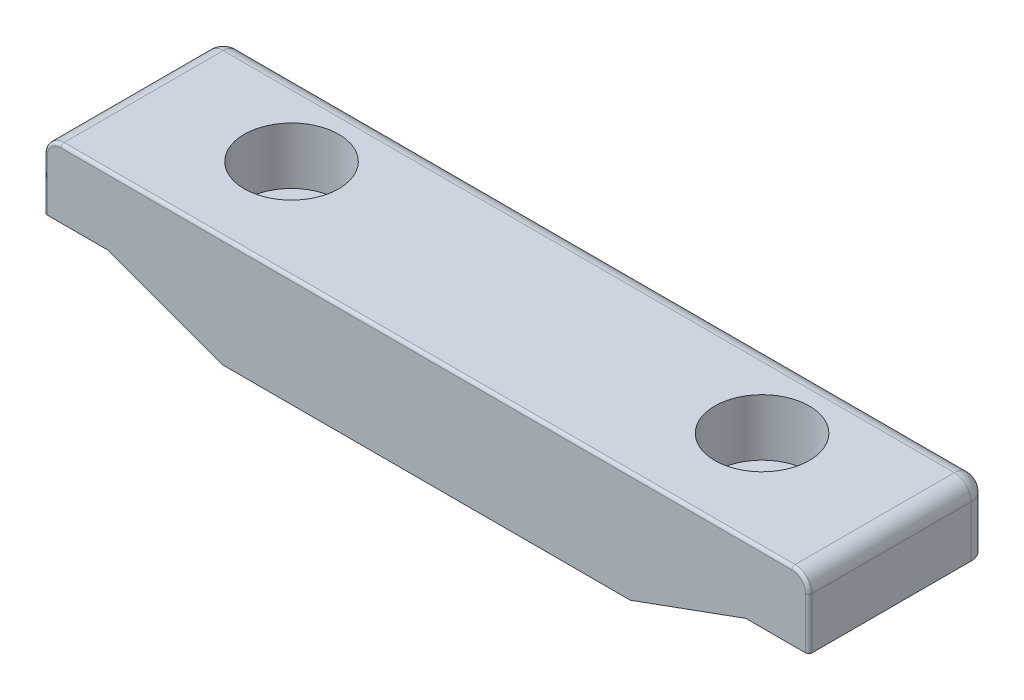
ISO-10303-21;
HEADER;
FILE_DESCRIPTION(('STEP AP214'),'2;1');
FILE_NAME('part.step','',(''),(''),'','','');
FILE_SCHEMA(('AUTOMOTIVE_DESIGN { 1 0 10303 214 1 1 1 1 }'));
ENDSEC;
DATA;
#1=APPLICATION_CONTEXT('core data for automotive mechanical design processes');
#2=APPLICATION_PROTOCOL_DEFINITION('international standard','automotive_design',2000,#1);
#3=PRODUCT_CONTEXT('',#1,'mechanical');
#4=PRODUCT('Part','Part','',(#3));
#5=PRODUCT_RELATED_PRODUCT_CATEGORY('part','',(#4));
#6=PRODUCT_DEFINITION_FORMATION('','',#4);
#7=PRODUCT_DEFINITION_CONTEXT('part definition',#1,'design');
#8=PRODUCT_DEFINITION('design','',#6,#7);
#9=PRODUCT_DEFINITION_SHAPE('','',#8);
#10=(LENGTH_UNIT() NAMED_UNIT(*) SI_UNIT(.MILLI.,.METRE.));
#11=(NAMED_UNIT(*) PLANE_ANGLE_UNIT() SI_UNIT($,.RADIAN.));
#12=(NAMED_UNIT(*) SI_UNIT($,.STERADIAN.) SOLID_ANGLE_UNIT());
#13=UNCERTAINTY_MEASURE_WITH_UNIT(LENGTH_MEASURE(1.E-05),#10,'distance_accuracy_value','');
#14=(GEOMETRIC_REPRESENTATION_CONTEXT(3) GLOBAL_UNCERTAINTY_ASSIGNED_CONTEXT((#13)) GLOBAL_UNIT_ASSIGNED_CONTEXT((#10,
#11,#12)) REPRESENTATION_CONTEXT('',''));
#15=CARTESIAN_POINT('',(0.,0.,0.));
#16=DIRECTION('',(0.,0.,1.));
#17=DIRECTION('',(1.,0.,0.));
#18=AXIS2_PLACEMENT_3D('',#15,#16,#17);
#19=CARTESIAN_POINT('',(5.22466570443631,47.8485746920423,12.5060604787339));
#20=DIRECTION('',(-0.342020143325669,0.939692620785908,0.));
#21=DIRECTION('',(0.,0.,1.));
#22=AXIS2_PLACEMENT_3D('',#19,#20,#21);
#23=PLANE('',#22);
#24=CARTESIAN_POINT('',(-0.0219140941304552,45.9389758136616,2.95606047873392));
#25=CARTESIAN_POINT('',(-0.0219140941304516,45.9389758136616,8.45606047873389));
#26=CARTESIAN_POINT('',(-5.52191409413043,43.9371395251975,8.45606047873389));
#27=CARTESIAN_POINT('',(-5.52191409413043,43.9371395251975,2.95606047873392));
#28=CARTESIAN_POINT('',(-5.52191409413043,43.9371395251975,-2.54393952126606));
#29=CARTESIAN_POINT('',(-0.0219140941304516,45.9389758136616,-2.54393952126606));
#30=CARTESIAN_POINT('',(-0.0219140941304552,45.9389758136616,2.95606047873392));
#31=(BOUNDED_CURVE() B_SPLINE_CURVE(3,(#24,#25,#26,#27,#28,#29,#30),.UNSPECIFIED.,.T.,
.F.) B_SPLINE_CURVE_WITH_KNOTS((4,3,4),(0.,3.1415926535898,6.28318530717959),
.UNSPECIFIED.) CURVE() GEOMETRIC_REPRESENTATION_ITEM() RATIONAL_B_SPLINE_CURVE((1.,
0.333333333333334,0.333333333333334,1.,0.333333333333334,0.333333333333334,1.)) REPRESENTATION_ITEM(''));
#32=CARTESIAN_POINT('',(-0.0219140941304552,45.9389758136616,2.95606047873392));
#33=VERTEX_POINT('',#32);
#34=EDGE_CURVE('E241',#33,#33,#31,.T.);
#35=ORIENTED_EDGE('',*,*,#34,.F.);
#36=EDGE_LOOP('',(#35));
#37=FACE_BOUND('',#36,.T.);
#38=DIRECTION('',(0.939692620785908,0.342020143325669,0.));
#39=VECTOR('',#38,1.);
#40=CARTESIAN_POINT('',(5.22466570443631,47.8485746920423,-4.54393952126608));
#41=LINE('',#40,#39);
#42=CARTESIAN_POINT('',(-5.76358704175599,43.8491777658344,-4.54393952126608));
#43=VERTEX_POINT('',#42);
#44=CARTESIAN_POINT('',(5.22632263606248,47.8491777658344,-4.54393952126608));
#45=VERTEX_POINT('',#44);
#46=EDGE_CURVE('E361',#43,#45,#41,.T.);
#47=ORIENTED_EDGE('',*,*,#46,.T.);
#48=DIRECTION('',(0.,0.,-1.));
#49=VECTOR('',#48,1.);
#50=CARTESIAN_POINT('',(5.22632263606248,47.8491777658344,12.5060604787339));
#51=LINE('',#50,#49);
#52=CARTESIAN_POINT('',(5.22632263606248,47.8491777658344,12.5060604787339));
#53=VERTEX_POINT('',#52);
#54=EDGE_CURVE('E262',#53,#45,#51,.T.);
#55=ORIENTED_EDGE('',*,*,#54,.F.);
#56=DIRECTION('',(0.939692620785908,0.342020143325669,0.));
#57=VECTOR('',#56,1.);
#58=CARTESIAN_POINT('',(5.22466570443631,47.8485746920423,12.5060604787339));
#59=LINE('',#58,#57);
#60=CARTESIAN_POINT('',(-5.76358704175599,43.8491777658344,12.5060604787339));
#61=VERTEX_POINT('',#60);
#62=EDGE_CURVE('E230',#61,#53,#59,.T.);
#63=ORIENTED_EDGE('',*,*,#62,.F.);
#64=DIRECTION('',(0.,0.,-1.));
#65=VECTOR('',#64,1.);
#66=CARTESIAN_POINT('',(-5.76358704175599,43.8491777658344,12.5060604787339));
#67=LINE('',#66,#65);
#68=EDGE_CURVE('E11',#61,#43,#67,.T.);
#69=ORIENTED_EDGE('',*,*,#68,.T.);
#70=EDGE_LOOP('',(#47,#55,#63,#69));
#71=FACE_BOUND('',#70,.T.);
#72=ADVANCED_FACE('F16',(#37,#71),#23,.F.);
#73=CARTESIAN_POINT('',(-5.76182377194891,43.8491777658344,12.5060604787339));
#74=DIRECTION('',(0.,1.,0.));
#75=DIRECTION('',(1.,0.,0.));
#76=AXIS2_PLACEMENT_3D('',#73,#74,#75);
#77=PLANE('',#76);
#78=DIRECTION('',(1.,0.,0.));
#79=VECTOR('',#78,1.);
#80=CARTESIAN_POINT('',(-5.76182377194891,43.8491777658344,-4.54393952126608));
#81=LINE('',#80,#79);
#82=CARTESIAN_POINT('',(-44.5802411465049,43.8491777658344,-4.54393952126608));
#83=VERTEX_POINT('',#82);
#84=EDGE_CURVE('E365',#83,#43,#81,.T.);
#85=ORIENTED_EDGE('',*,*,#84,.T.);
#86=ORIENTED_EDGE('',*,*,#68,.F.);
#87=DIRECTION('',(1.,0.,0.));
#88=VECTOR('',#87,1.);
#89=CARTESIAN_POINT('',(-5.76182377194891,43.8491777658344,12.5060604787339));
#90=LINE('',#89,#88);
#91=CARTESIAN_POINT('',(-44.5802411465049,43.8491777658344,12.5060604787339));
#92=VERTEX_POINT('',#91);
#93=EDGE_CURVE('E238',#92,#61,#90,.T.);
#94=ORIENTED_EDGE('',*,*,#93,.F.);
#95=DIRECTION('',(0.,0.,-1.));
#96=VECTOR('',#95,1.);
#97=CARTESIAN_POINT('',(-44.5802411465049,43.8491777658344,12.5060604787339));
#98=LINE('',#97,#96);
#99=EDGE_CURVE('E24',#92,#83,#98,.T.);
#100=ORIENTED_EDGE('',*,*,#99,.T.);
#101=EDGE_LOOP('',(#85,#86,#94,#100));
#102=FACE_BOUND('',#101,.T.);
#103=ADVANCED_FACE('F416',(#102),#77,.F.);
#104=CARTESIAN_POINT('',(-55.5684938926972,47.8485746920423,12.5060604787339));
#105=DIRECTION('',(0.342020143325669,0.939692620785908,0.));
#106=DIRECTION('',(0.,0.,-1.));
#107=AXIS2_PLACEMENT_3D('',#104,#105,#106);
#108=PLANE('',#107);
#109=CARTESIAN_POINT('',(-50.3219140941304,45.9389758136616,2.95606047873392));
#110=CARTESIAN_POINT('',(-50.3219140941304,45.9389758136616,-2.54393952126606));
#111=CARTESIAN_POINT('',(-44.8219140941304,43.9371395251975,-2.54393952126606));
#112=CARTESIAN_POINT('',(-44.8219140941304,43.9371395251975,2.95606047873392));
#113=CARTESIAN_POINT('',(-44.8219140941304,43.9371395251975,8.45606047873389));
#114=CARTESIAN_POINT('',(-50.3219140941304,45.9389758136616,8.45606047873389));
#115=CARTESIAN_POINT('',(-50.3219140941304,45.9389758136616,2.95606047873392));
#116=(BOUNDED_CURVE() B_SPLINE_CURVE(3,(#109,#110,#111,#112,#113,#114,#115),.UNSPECIFIED.,.T.,
.F.) B_SPLINE_CURVE_WITH_KNOTS((4,3,4),(0.,3.1415926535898,6.28318530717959),
.UNSPECIFIED.) CURVE() GEOMETRIC_REPRESENTATION_ITEM() RATIONAL_B_SPLINE_CURVE((1.,
0.333333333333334,0.333333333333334,1.,0.333333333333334,0.333333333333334,1.)) REPRESENTATION_ITEM(''));
#117=CARTESIAN_POINT('',(-50.3219140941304,45.9389758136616,2.95606047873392));
#118=VERTEX_POINT('',#117);
#119=EDGE_CURVE('E252',#118,#118,#116,.T.);
#120=ORIENTED_EDGE('',*,*,#119,.F.);
#121=EDGE_LOOP('',(#120));
#122=FACE_BOUND('',#121,.T.);
#123=DIRECTION('',(0.939692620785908,-0.342020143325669,0.));
#124=VECTOR('',#123,1.);
#125=CARTESIAN_POINT('',(-55.5684938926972,47.8485746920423,-4.54393952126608));
#126=LINE('',#125,#124);
#127=CARTESIAN_POINT('',(-55.5701508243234,47.8491777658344,-4.54393952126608));
#128=VERTEX_POINT('',#127);
#129=EDGE_CURVE('E280',#128,#83,#126,.T.);
#130=ORIENTED_EDGE('',*,*,#129,.T.);
#131=ORIENTED_EDGE('',*,*,#99,.F.);
#132=DIRECTION('',(0.939692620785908,-0.342020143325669,0.));
#133=VECTOR('',#132,1.);
#134=CARTESIAN_POINT('',(-55.5684938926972,47.8485746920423,12.5060604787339));
#135=LINE('',#134,#133);
#136=CARTESIAN_POINT('',(-55.5701508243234,47.8491777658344,12.5060604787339));
#137=VERTEX_POINT('',#136);
#138=EDGE_CURVE('E287',#137,#92,#135,.T.);
#139=ORIENTED_EDGE('',*,*,#138,.F.);
#140=DIRECTION('',(0.,0.,-1.));
#141=VECTOR('',#140,1.);
#142=CARTESIAN_POINT('',(-55.5701508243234,47.8491777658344,12.5060604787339));
#143=LINE('',#142,#141);
#144=EDGE_CURVE('E410',#137,#128,#143,.T.);
#145=ORIENTED_EDGE('',*,*,#144,.T.);
#146=EDGE_LOOP('',(#130,#131,#139,#145));
#147=FACE_BOUND('',#146,.T.);
#148=ADVANCED_FACE('F422',(#122,#147),#108,.F.);
#149=CARTESIAN_POINT('',(-61.5719140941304,47.8491777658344,12.5060604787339));
#150=DIRECTION('',(0.,1.,0.));
#151=DIRECTION('',(1.,0.,0.));
#152=AXIS2_PLACEMENT_3D('',#149,#150,#151);
#153=PLANE('',#152);
#154=CARTESIAN_POINT('',(-59.9719140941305,47.8491777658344,-2.94393952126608));
#155=DIRECTION('',(0.,-1.,0.));
#156=DIRECTION('',(0.,0.,1.));
#157=AXIS2_PLACEMENT_3D('',#154,#155,#156);
#158=CIRCLE('',#157,1.6);
#159=CARTESIAN_POINT('',(-61.5719140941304,47.8491777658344,-2.94393952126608));
#160=VERTEX_POINT('',#159);
#161=CARTESIAN_POINT('',(-59.9719140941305,47.8491777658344,-4.54393952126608));
#162=VERTEX_POINT('',#161);
#163=EDGE_CURVE('E308',#160,#162,#158,.T.);
#164=ORIENTED_EDGE('',*,*,#163,.T.);
#165=DIRECTION('',(1.,0.,0.));
#166=VECTOR('',#165,1.);
#167=CARTESIAN_POINT('',(-61.5719140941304,47.8491777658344,-4.54393952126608));
#168=LINE('',#167,#166);
#169=EDGE_CURVE('E275',#162,#128,#168,.T.);
#170=ORIENTED_EDGE('',*,*,#169,.T.);
#171=ORIENTED_EDGE('',*,*,#144,.F.);
#172=DIRECTION('',(1.,0.,0.));
#173=VECTOR('',#172,1.);
#174=CARTESIAN_POINT('',(-61.5719140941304,47.8491777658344,12.5060604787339));
#175=LINE('',#174,#173);
#176=CARTESIAN_POINT('',(-61.2719140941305,47.8491777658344,12.5060604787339));
#177=VERTEX_POINT('',#176);
#178=EDGE_CURVE('E268',#177,#137,#175,.T.);
#179=ORIENTED_EDGE('',*,*,#178,.F.);
#180=CARTESIAN_POINT('',(-61.2719140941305,47.8491777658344,12.2060604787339));
#181=DIRECTION('',(0.,-1.,0.));
#182=DIRECTION('',(0.,0.,1.));
#183=AXIS2_PLACEMENT_3D('',#180,#181,#182);
#184=CIRCLE('',#183,0.3);
#185=CARTESIAN_POINT('',(-61.5719140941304,47.8491777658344,12.2060604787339));
#186=VERTEX_POINT('',#185);
#187=EDGE_CURVE('E311',#177,#186,#184,.T.);
#188=ORIENTED_EDGE('',*,*,#187,.T.);
#189=DIRECTION('',(0.,0.,-1.));
#190=VECTOR('',#189,1.);
#191=CARTESIAN_POINT('',(-61.5719140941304,47.8491777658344,12.5060604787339));
#192=LINE('',#191,#190);
#193=EDGE_CURVE('E341',#186,#160,#192,.T.);
#194=ORIENTED_EDGE('',*,*,#193,.T.);
#195=EDGE_LOOP('',(#164,#170,#171,#179,#188,#194));
#196=FACE_BOUND('',#195,.T.);
#197=ADVANCED_FACE('F435',(#196),#153,.F.);
#198=CARTESIAN_POINT('',(11.2280859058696,47.8491777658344,12.5060604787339));
#199=DIRECTION('',(0.,1.,0.));
#200=DIRECTION('',(1.,0.,0.));
#201=AXIS2_PLACEMENT_3D('',#198,#199,#200);
#202=PLANE('',#201);
#203=CARTESIAN_POINT('',(9.62808590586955,47.8491777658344,-2.94393952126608));
#204=DIRECTION('',(0.,-1.,0.));
#205=DIRECTION('',(0.,0.,1.));
#206=AXIS2_PLACEMENT_3D('',#203,#204,#205);
#207=CIRCLE('',#206,1.6);
#208=CARTESIAN_POINT('',(9.62808590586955,47.8491777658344,-4.54393952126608));
#209=VERTEX_POINT('',#208);
#210=CARTESIAN_POINT('',(11.2280859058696,47.8491777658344,-2.94393952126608));
#211=VERTEX_POINT('',#210);
#212=EDGE_CURVE('E379',#209,#211,#207,.T.);
#213=ORIENTED_EDGE('',*,*,#212,.T.);
#214=DIRECTION('',(0.,0.,-1.));
#215=VECTOR('',#214,1.);
#216=CARTESIAN_POINT('',(11.2280859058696,47.8491777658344,12.5060604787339));
#217=LINE('',#216,#215);
#218=CARTESIAN_POINT('',(11.2280859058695,47.8491777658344,12.2060604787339));
#219=VERTEX_POINT('',#218);
#220=EDGE_CURVE('E229',#219,#211,#217,.T.);
#221=ORIENTED_EDGE('',*,*,#220,.F.);
#222=CARTESIAN_POINT('',(10.9280859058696,47.8491777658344,12.2060604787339));
#223=DIRECTION('',(0.,-1.,0.));
#224=DIRECTION('',(0.,0.,1.));
#225=AXIS2_PLACEMENT_3D('',#222,#223,#224);
#226=CIRCLE('',#225,0.3);
#227=CARTESIAN_POINT('',(10.9280859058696,47.8491777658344,12.5060604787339));
#228=VERTEX_POINT('',#227);
#229=EDGE_CURVE('E199',#219,#228,#226,.T.);
#230=ORIENTED_EDGE('',*,*,#229,.T.);
#231=DIRECTION('',(1.,0.,0.));
#232=VECTOR('',#231,1.);
#233=CARTESIAN_POINT('',(11.2280859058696,47.8491777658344,12.5060604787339));
#234=LINE('',#233,#232);
#235=EDGE_CURVE('E245',#53,#228,#234,.T.);
#236=ORIENTED_EDGE('',*,*,#235,.F.);
#237=ORIENTED_EDGE('',*,*,#54,.T.);
#238=DIRECTION('',(1.,0.,0.));
#239=VECTOR('',#238,1.);
#240=CARTESIAN_POINT('',(11.2280859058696,47.8491777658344,-4.54393952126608));
#241=LINE('',#240,#239);
#242=EDGE_CURVE('E357',#45,#209,#241,.T.);
#243=ORIENTED_EDGE('',*,*,#242,.T.);
#244=EDGE_LOOP('',(#213,#221,#230,#236,#237,#243));
#245=FACE_BOUND('',#244,.T.);
#246=ADVANCED_FACE('F455',(#245),#202,.F.);
#247=CARTESIAN_POINT('',(-2.77191409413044,54.3391777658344,2.95606047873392));
#248=DIRECTION('',(0.,1.,0.));
#249=DIRECTION('',(0.,0.,1.));
#250=AXIS2_PLACEMENT_3D('',#247,#248,#249);
#251=CYLINDRICAL_SURFACE('',#250,4.5);
#252=CARTESIAN_POINT('',(-2.77191409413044,48.9391777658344,2.95606047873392));
#253=DIRECTION('',(0.,1.,0.));
#254=DIRECTION('',(0.,0.,1.));
#255=AXIS2_PLACEMENT_3D('',#252,#253,#254);
#256=CIRCLE('',#255,4.5);
#257=CARTESIAN_POINT('',(-2.77191409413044,48.9391777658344,7.45606047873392));
#258=VERTEX_POINT('',#257);
#259=EDGE_CURVE('E33',#258,#258,#256,.T.);
#260=ORIENTED_EDGE('',*,*,#259,.F.);
#261=EDGE_LOOP('',(#260));
#262=FACE_BOUND('',#261,.T.);
#263=CARTESIAN_POINT('',(-2.77191409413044,54.3391777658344,2.95606047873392));
#264=DIRECTION('',(0.,1.,0.));
#265=DIRECTION('',(0.,0.,1.));
#266=AXIS2_PLACEMENT_3D('',#263,#264,#265);
#267=CIRCLE('',#266,4.5);
#268=CARTESIAN_POINT('',(-2.77191409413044,54.3391777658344,7.45606047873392));
#269=VERTEX_POINT('',#268);
#270=EDGE_CURVE('E331',#269,#269,#267,.T.);
#271=ORIENTED_EDGE('',*,*,#270,.T.);
#272=EDGE_LOOP('',(#271));
#273=FACE_BOUND('',#272,.T.);
#274=ADVANCED_FACE('F501',(#262,#273),#251,.F.);
#275=CARTESIAN_POINT('',(-0.0219140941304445,48.9391777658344,2.95606047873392));
#276=DIRECTION('',(0.,-1.,0.));
#277=DIRECTION('',(0.,0.,-1.));
#278=AXIS2_PLACEMENT_3D('',#275,#276,#277);
#279=PLANE('',#278);
#280=CARTESIAN_POINT('',(-2.77191409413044,48.9391777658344,2.95606047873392));
#281=DIRECTION('',(0.,1.,0.));
#282=DIRECTION('',(0.,0.,1.));
#283=AXIS2_PLACEMENT_3D('',#280,#281,#282);
#284=CIRCLE('',#283,2.75);
#285=CARTESIAN_POINT('',(-2.77191409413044,48.9391777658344,5.70606047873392));
#286=VERTEX_POINT('',#285);
#287=EDGE_CURVE('E246',#286,#286,#284,.T.);
#288=ORIENTED_EDGE('',*,*,#287,.F.);
#289=EDGE_LOOP('',(#288));
#290=FACE_BOUND('',#289,.T.);
#291=ORIENTED_EDGE('',*,*,#259,.T.);
#292=EDGE_LOOP('',(#291));
#293=FACE_BOUND('',#292,.T.);
#294=ADVANCED_FACE('F498',(#290,#293),#279,.F.);
#295=CARTESIAN_POINT('',(-47.5719140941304,54.3391777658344,2.95606047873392));
#296=DIRECTION('',(0.,1.,0.));
#297=DIRECTION('',(0.,0.,1.));
#298=AXIS2_PLACEMENT_3D('',#295,#296,#297);
#299=CYLINDRICAL_SURFACE('',#298,4.5);
#300=CARTESIAN_POINT('',(-47.5719140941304,48.9391777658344,2.95606047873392));
#301=DIRECTION('',(0.,1.,0.));
#302=DIRECTION('',(0.,0.,1.));
#303=AXIS2_PLACEMENT_3D('',#300,#301,#302);
#304=CIRCLE('',#303,4.5);
#305=CARTESIAN_POINT('',(-47.5719140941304,48.9391777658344,7.45606047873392));
#306=VERTEX_POINT('',#305);
#307=EDGE_CURVE('E40',#306,#306,#304,.T.);
#308=ORIENTED_EDGE('',*,*,#307,.F.);
#309=EDGE_LOOP('',(#308));
#310=FACE_BOUND('',#309,.T.);
#311=CARTESIAN_POINT('',(-47.5719140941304,54.3391777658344,2.95606047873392));
#312=DIRECTION('',(0.,1.,0.));
#313=DIRECTION('',(0.,0.,1.));
#314=AXIS2_PLACEMENT_3D('',#311,#312,#313);
#315=CIRCLE('',#314,4.5);
#316=CARTESIAN_POINT('',(-47.5719140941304,54.3391777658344,7.45606047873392));
#317=VERTEX_POINT('',#316);
#318=EDGE_CURVE('E334',#317,#317,#315,.T.);
#319=ORIENTED_EDGE('',*,*,#318,.T.);
#320=EDGE_LOOP('',(#319));
#321=FACE_BOUND('',#320,.T.);
#322=ADVANCED_FACE('F500',(#310,#321),#299,.F.);
#323=CARTESIAN_POINT('',(-44.8219140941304,48.9391777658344,2.95606047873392));
#324=DIRECTION('',(0.,-1.,0.));
#325=DIRECTION('',(0.,0.,-1.));
#326=AXIS2_PLACEMENT_3D('',#323,#324,#325);
#327=PLANE('',#326);
#328=CARTESIAN_POINT('',(-47.5719140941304,48.9391777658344,2.95606047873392));
#329=DIRECTION('',(0.,1.,0.));
#330=DIRECTION('',(0.,0.,1.));
#331=AXIS2_PLACEMENT_3D('',#328,#329,#330);
#332=CIRCLE('',#331,2.75);
#333=CARTESIAN_POINT('',(-47.5719140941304,48.9391777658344,5.70606047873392));
#334=VERTEX_POINT('',#333);
#335=EDGE_CURVE('E247',#334,#334,#332,.T.);
#336=ORIENTED_EDGE('',*,*,#335,.F.);
#337=EDGE_LOOP('',(#336));
#338=FACE_BOUND('',#337,.T.);
#339=ORIENTED_EDGE('',*,*,#307,.T.);
#340=EDGE_LOOP('',(#339));
#341=FACE_BOUND('',#340,.T.);
#342=ADVANCED_FACE('F507',(#338,#341),#327,.F.);
#343=CARTESIAN_POINT('',(10.9280859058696,25.3391777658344,12.2060604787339));
#344=DIRECTION('',(0.,-1.,0.));
#345=DIRECTION('',(1.,0.,0.));
#346=AXIS2_PLACEMENT_3D('',#343,#344,#345);
#347=CYLINDRICAL_SURFACE('',#346,0.3);
#348=ORIENTED_EDGE('',*,*,#229,.F.);
#349=DIRECTION('',(0.,-1.,0.));
#350=VECTOR('',#349,1.);
#351=CARTESIAN_POINT('',(11.2280859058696,-3.66082223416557,12.2060604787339));
#352=LINE('',#351,#350);
#353=CARTESIAN_POINT('',(11.2280859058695,52.7391777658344,12.2060604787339));
#354=VERTEX_POINT('',#353);
#355=EDGE_CURVE('E220',#354,#219,#352,.T.);
#356=ORIENTED_EDGE('',*,*,#355,.F.);
#357=CARTESIAN_POINT('',(10.9280859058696,52.7391777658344,12.2060604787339));
#358=DIRECTION('',(0.,-1.,0.));
#359=DIRECTION('',(0.,0.,-1.));
#360=AXIS2_PLACEMENT_3D('',#357,#358,#359);
#361=CIRCLE('',#360,0.3);
#362=CARTESIAN_POINT('',(10.9280859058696,52.7391777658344,12.5060604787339));
#363=VERTEX_POINT('',#362);
#364=EDGE_CURVE('E187',#354,#363,#361,.T.);
#365=ORIENTED_EDGE('',*,*,#364,.T.);
#366=DIRECTION('',(0.,1.,0.));
#367=VECTOR('',#366,1.);
#368=CARTESIAN_POINT('',(10.9280859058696,52.7391777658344,12.5060604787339));
#369=LINE('',#368,#367);
#370=EDGE_CURVE('E270',#228,#363,#369,.T.);
#371=ORIENTED_EDGE('',*,*,#370,.F.);
#372=EDGE_LOOP('',(#348,#356,#365,#371));
#373=FACE_BOUND('',#372,.T.);
#374=ADVANCED_FACE('F226',(#373),#347,.T.);
#375=CARTESIAN_POINT('',(9.62808590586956,52.7391777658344,12.2060604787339));
#376=DIRECTION('',(0.,0.,1.));
#377=DIRECTION('',(1.,0.,0.));
#378=AXIS2_PLACEMENT_3D('',#375,#376,#377);
#379=TOROIDAL_SURFACE('',#378,1.3,0.3);
#380=CARTESIAN_POINT('',(9.62808590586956,54.0391777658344,12.2060604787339));
#381=DIRECTION('',(1.,0.,0.));
#382=DIRECTION('',(0.,0.,-1.));
#383=AXIS2_PLACEMENT_3D('',#380,#381,#382);
#384=CIRCLE('',#383,0.3);
#385=CARTESIAN_POINT('',(9.62808590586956,54.3391777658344,12.2060604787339));
#386=VERTEX_POINT('',#385);
#387=CARTESIAN_POINT('',(9.62808590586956,54.0391777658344,12.5060604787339));
#388=VERTEX_POINT('',#387);
#389=EDGE_CURVE('E200',#386,#388,#384,.T.);
#390=ORIENTED_EDGE('',*,*,#389,.T.);
#391=CARTESIAN_POINT('',(9.62808590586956,52.7391777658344,12.5060604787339));
#392=DIRECTION('',(0.,0.,1.));
#393=DIRECTION('',(1.,0.,0.));
#394=AXIS2_PLACEMENT_3D('',#391,#392,#393);
#395=CIRCLE('',#394,1.3);
#396=EDGE_CURVE('E193',#363,#388,#395,.T.);
#397=ORIENTED_EDGE('',*,*,#396,.F.);
#398=ORIENTED_EDGE('',*,*,#364,.F.);
#399=CARTESIAN_POINT('',(9.62808590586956,52.7391777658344,12.2060604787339));
#400=DIRECTION('',(0.,0.,-1.));
#401=DIRECTION('',(1.,0.,0.));
#402=AXIS2_PLACEMENT_3D('',#399,#400,#401);
#403=CIRCLE('',#402,1.6);
#404=EDGE_CURVE('E190',#386,#354,#403,.T.);
#405=ORIENTED_EDGE('',*,*,#404,.F.);
#406=EDGE_LOOP('',(#390,#397,#398,#405));
#407=FACE_BOUND('',#406,.T.);
#408=ADVANCED_FACE('F189',(#407),#379,.T.);
#409=CARTESIAN_POINT('',(-25.1719140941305,54.0391777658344,12.2060604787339));
#410=DIRECTION('',(1.,0.,0.));
#411=DIRECTION('',(0.,0.,-1.));
#412=AXIS2_PLACEMENT_3D('',#409,#410,#411);
#413=CYLINDRICAL_SURFACE('',#412,0.3);
#414=CARTESIAN_POINT('',(-59.9719140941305,54.0391777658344,12.2060604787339));
#415=DIRECTION('',(1.,0.,0.));
#416=DIRECTION('',(0.,0.,-1.));
#417=AXIS2_PLACEMENT_3D('',#414,#415,#416);
#418=CIRCLE('',#417,0.3);
#419=CARTESIAN_POINT('',(-59.9719140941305,54.3391777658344,12.2060604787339));
#420=VERTEX_POINT('',#419);
#421=CARTESIAN_POINT('',(-59.9719140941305,54.0391777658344,12.5060604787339));
#422=VERTEX_POINT('',#421);
#423=EDGE_CURVE('E324',#420,#422,#418,.T.);
#424=ORIENTED_EDGE('',*,*,#423,.T.);
#425=DIRECTION('',(-1.,0.,0.));
#426=VECTOR('',#425,1.);
#427=CARTESIAN_POINT('',(-59.9719140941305,54.0391777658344,12.5060604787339));
#428=LINE('',#427,#426);
#429=EDGE_CURVE('E290',#388,#422,#428,.T.);
#430=ORIENTED_EDGE('',*,*,#429,.F.);
#431=ORIENTED_EDGE('',*,*,#389,.F.);
#432=DIRECTION('',(1.,0.,0.));
#433=VECTOR('',#432,1.);
#434=CARTESIAN_POINT('',(9.62808590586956,54.3391777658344,12.2060604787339));
#435=LINE('',#434,#433);
#436=EDGE_CURVE('E319',#420,#386,#435,.T.);
#437=ORIENTED_EDGE('',*,*,#436,.F.);
#438=EDGE_LOOP('',(#424,#430,#431,#437));
#439=FACE_BOUND('',#438,.T.);
#440=ADVANCED_FACE('F459',(#439),#413,.T.);
#441=CARTESIAN_POINT('',(-59.9719140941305,52.7391777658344,12.2060604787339));
#442=DIRECTION('',(0.,0.,1.));
#443=DIRECTION('',(1.,0.,0.));
#444=AXIS2_PLACEMENT_3D('',#441,#442,#443);
#445=TOROIDAL_SURFACE('',#444,1.3,0.3);
#446=CARTESIAN_POINT('',(-61.2719140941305,52.7391777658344,12.2060604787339));
#447=DIRECTION('',(0.,1.,0.));
#448=DIRECTION('',(0.,0.,1.));
#449=AXIS2_PLACEMENT_3D('',#446,#447,#448);
#450=CIRCLE('',#449,0.3);
#451=CARTESIAN_POINT('',(-61.5719140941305,52.7391777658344,12.2060604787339));
#452=VERTEX_POINT('',#451);
#453=CARTESIAN_POINT('',(-61.2719140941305,52.7391777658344,12.5060604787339));
#454=VERTEX_POINT('',#453);
#455=EDGE_CURVE('E313',#452,#454,#450,.T.);
#456=ORIENTED_EDGE('',*,*,#455,.T.);
#457=CARTESIAN_POINT('',(-59.9719140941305,52.7391777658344,12.5060604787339));
#458=DIRECTION('',(0.,0.,1.));
#459=DIRECTION('',(1.,0.,0.));
#460=AXIS2_PLACEMENT_3D('',#457,#458,#459);
#461=CIRCLE('',#460,1.3);
#462=EDGE_CURVE('E269',#422,#454,#461,.T.);
#463=ORIENTED_EDGE('',*,*,#462,.F.);
#464=ORIENTED_EDGE('',*,*,#423,.F.);
#465=CARTESIAN_POINT('',(-59.9719140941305,52.7391777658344,12.2060604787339));
#466=DIRECTION('',(0.,0.,-1.));
#467=DIRECTION('',(1.,0.,0.));
#468=AXIS2_PLACEMENT_3D('',#465,#466,#467);
#469=CIRCLE('',#468,1.6);
#470=EDGE_CURVE('E314',#452,#420,#469,.T.);
#471=ORIENTED_EDGE('',*,*,#470,.F.);
#472=EDGE_LOOP('',(#456,#463,#464,#471));
#473=FACE_BOUND('',#472,.T.);
#474=ADVANCED_FACE('F463',(#473),#445,.T.);
#475=CARTESIAN_POINT('',(-61.2719140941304,25.3391777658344,12.2060604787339));
#476=DIRECTION('',(0.,1.,0.));
#477=DIRECTION('',(-1.,0.,0.));
#478=AXIS2_PLACEMENT_3D('',#475,#476,#477);
#479=CYLINDRICAL_SURFACE('',#478,0.3);
#480=ORIENTED_EDGE('',*,*,#187,.F.);
#481=DIRECTION('',(0.,-1.,0.));
#482=VECTOR('',#481,1.);
#483=CARTESIAN_POINT('',(-61.2719140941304,-3.66082223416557,12.5060604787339));
#484=LINE('',#483,#482);
#485=EDGE_CURVE('E264',#454,#177,#484,.T.);
#486=ORIENTED_EDGE('',*,*,#485,.F.);
#487=ORIENTED_EDGE('',*,*,#455,.F.);
#488=DIRECTION('',(0.,1.,0.));
#489=VECTOR('',#488,1.);
#490=CARTESIAN_POINT('',(-61.5719140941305,52.7391777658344,12.2060604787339));
#491=LINE('',#490,#489);
#492=EDGE_CURVE('E345',#186,#452,#491,.T.);
#493=ORIENTED_EDGE('',*,*,#492,.F.);
#494=EDGE_LOOP('',(#480,#486,#487,#493));
#495=FACE_BOUND('',#494,.T.);
#496=ADVANCED_FACE('F466',(#495),#479,.T.);
#497=CARTESIAN_POINT('',(-59.9719140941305,52.7391777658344,12.5060604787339));
#498=DIRECTION('',(0.,0.,-1.));
#499=DIRECTION('',(-1.,0.,0.));
#500=AXIS2_PLACEMENT_3D('',#497,#498,#499);
#501=CYLINDRICAL_SURFACE('',#500,1.6);
#502=DIRECTION('',(0.,0.,-1.));
#503=VECTOR('',#502,1.);
#504=CARTESIAN_POINT('',(-61.5719140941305,52.7391777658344,12.5060604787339));
#505=LINE('',#504,#503);
#506=CARTESIAN_POINT('',(-61.5719140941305,52.7391777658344,-2.94393952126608));
#507=VERTEX_POINT('',#506);
#508=EDGE_CURVE('E349',#452,#507,#505,.T.);
#509=ORIENTED_EDGE('',*,*,#508,.F.);
#510=ORIENTED_EDGE('',*,*,#470,.T.);
#511=DIRECTION('',(0.,0.,1.));
#512=VECTOR('',#511,1.);
#513=CARTESIAN_POINT('',(-59.9719140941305,54.3391777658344,12.5060604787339));
#514=LINE('',#513,#512);
#515=CARTESIAN_POINT('',(-59.9719140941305,54.3391777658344,-2.94393952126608));
#516=VERTEX_POINT('',#515);
#517=EDGE_CURVE('E224',#516,#420,#514,.T.);
#518=ORIENTED_EDGE('',*,*,#517,.F.);
#519=CARTESIAN_POINT('',(-59.9719140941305,52.7391777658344,-2.94393952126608));
#520=DIRECTION('',(0.,0.,1.));
#521=DIRECTION('',(-1.,0.,0.));
#522=AXIS2_PLACEMENT_3D('',#519,#520,#521);
#523=CIRCLE('',#522,1.6);
#524=EDGE_CURVE('E394',#516,#507,#523,.T.);
#525=ORIENTED_EDGE('',*,*,#524,.T.);
#526=EDGE_LOOP('',(#509,#510,#518,#525));
#527=FACE_BOUND('',#526,.T.);
#528=ADVANCED_FACE('F471',(#527),#501,.T.);
#529=CARTESIAN_POINT('',(-59.9719140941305,52.7391777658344,-2.94393952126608));
#530=DIRECTION('',(0.,1.,0.));
#531=DIRECTION('',(1.,0.,0.));
#532=AXIS2_PLACEMENT_3D('',#529,#530,#531);
#533=SPHERICAL_SURFACE('',#532,1.6);
#534=CARTESIAN_POINT('',(-59.9719140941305,52.7391777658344,-2.94393952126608));
#535=DIRECTION('',(-1.,0.,0.));
#536=DIRECTION('',(0.,0.,1.));
#537=AXIS2_PLACEMENT_3D('',#534,#535,#536);
#538=CIRCLE('',#537,1.6);
#539=CARTESIAN_POINT('',(-59.9719140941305,52.7391777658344,-4.54393952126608));
#540=VERTEX_POINT('',#539);
#541=EDGE_CURVE('E307',#516,#540,#538,.T.);
#542=ORIENTED_EDGE('',*,*,#541,.T.);
#543=CARTESIAN_POINT('',(-59.9719140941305,52.7391777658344,-2.94393952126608));
#544=DIRECTION('',(0.,1.,0.));
#545=DIRECTION('',(0.,0.,1.));
#546=AXIS2_PLACEMENT_3D('',#543,#544,#545);
#547=CIRCLE('',#546,1.6);
#548=EDGE_CURVE('E303',#540,#507,#547,.T.);
#549=ORIENTED_EDGE('',*,*,#548,.T.);
#550=ORIENTED_EDGE('',*,*,#524,.F.);
#551=EDGE_LOOP('',(#542,#549,#550));
#552=FACE_BOUND('',#551,.T.);
#553=ADVANCED_FACE('F473',(#552),#533,.T.);
#554=CARTESIAN_POINT('',(-61.5719140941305,52.7391777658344,-2.94393952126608));
#555=DIRECTION('',(-1.,0.,0.));
#556=DIRECTION('',(0.,0.,1.));
#557=AXIS2_PLACEMENT_3D('',#554,#555,#556);
#558=CYLINDRICAL_SURFACE('',#557,1.6);
#559=CARTESIAN_POINT('',(9.62808590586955,52.7391777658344,-2.94393952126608));
#560=DIRECTION('',(-1.,0.,0.));
#561=DIRECTION('',(0.,1.,0.));
#562=AXIS2_PLACEMENT_3D('',#559,#560,#561);
#563=CIRCLE('',#562,1.6);
#564=CARTESIAN_POINT('',(9.62808590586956,54.3391777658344,-2.94393952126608));
#565=VERTEX_POINT('',#564);
#566=CARTESIAN_POINT('',(9.62808590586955,52.7391777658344,-4.54393952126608));
#567=VERTEX_POINT('',#566);
#568=EDGE_CURVE('E387',#565,#567,#563,.T.);
#569=ORIENTED_EDGE('',*,*,#568,.T.);
#570=DIRECTION('',(1.,0.,0.));
#571=VECTOR('',#570,1.);
#572=CARTESIAN_POINT('',(-25.1719140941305,52.7391777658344,-4.54393952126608));
#573=LINE('',#572,#571);
#574=EDGE_CURVE('E375',#540,#567,#573,.T.);
#575=ORIENTED_EDGE('',*,*,#574,.F.);
#576=ORIENTED_EDGE('',*,*,#541,.F.);
#577=DIRECTION('',(-1.,0.,0.));
#578=VECTOR('',#577,1.);
#579=CARTESIAN_POINT('',(-61.5719140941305,54.3391777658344,-2.94393952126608));
#580=LINE('',#579,#578);
#581=EDGE_CURVE('E327',#565,#516,#580,.T.);
#582=ORIENTED_EDGE('',*,*,#581,.F.);
#583=EDGE_LOOP('',(#569,#575,#576,#582));
#584=FACE_BOUND('',#583,.T.);
#585=ADVANCED_FACE('F447',(#584),#558,.T.);
#586=CARTESIAN_POINT('',(-59.9719140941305,54.3391777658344,-2.94393952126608));
#587=DIRECTION('',(0.,-1.,0.));
#588=DIRECTION('',(1.,0.,0.));
#589=AXIS2_PLACEMENT_3D('',#586,#587,#588);
#590=CYLINDRICAL_SURFACE('',#589,1.6);
#591=ORIENTED_EDGE('',*,*,#163,.F.);
#592=DIRECTION('',(0.,-1.,0.));
#593=VECTOR('',#592,1.);
#594=CARTESIAN_POINT('',(-61.5719140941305,54.3391777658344,-2.94393952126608));
#595=LINE('',#594,#593);
#596=EDGE_CURVE('E337',#507,#160,#595,.T.);
#597=ORIENTED_EDGE('',*,*,#596,.F.);
#598=ORIENTED_EDGE('',*,*,#548,.F.);
#599=DIRECTION('',(0.,1.,0.));
#600=VECTOR('',#599,1.);
#601=CARTESIAN_POINT('',(-59.9719140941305,25.3391777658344,-4.54393952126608));
#602=LINE('',#601,#600);
#603=EDGE_CURVE('E279',#162,#540,#602,.T.);
#604=ORIENTED_EDGE('',*,*,#603,.F.);
#605=EDGE_LOOP('',(#591,#597,#598,#604));
#606=FACE_BOUND('',#605,.T.);
#607=ADVANCED_FACE('F442',(#606),#590,.T.);
#608=CARTESIAN_POINT('',(9.62808590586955,52.7391777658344,-2.94393952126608));
#609=DIRECTION('',(0.,1.,0.));
#610=DIRECTION('',(1.,0.,0.));
#611=AXIS2_PLACEMENT_3D('',#608,#609,#610);
#612=SPHERICAL_SURFACE('',#611,1.6);
#613=CARTESIAN_POINT('',(9.62808590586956,52.7391777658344,-2.94393952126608));
#614=DIRECTION('',(0.,0.,-1.));
#615=DIRECTION('',(-1.,0.,0.));
#616=AXIS2_PLACEMENT_3D('',#613,#614,#615);
#617=CIRCLE('',#616,1.6);
#618=CARTESIAN_POINT('',(11.2280859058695,52.7391777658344,-2.94393952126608));
#619=VERTEX_POINT('',#618);
#620=EDGE_CURVE('E213',#565,#619,#617,.T.);
#621=ORIENTED_EDGE('',*,*,#620,.T.);
#622=CARTESIAN_POINT('',(9.62808590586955,52.7391777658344,-2.94393952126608));
#623=DIRECTION('',(0.,1.,0.));
#624=DIRECTION('',(0.,0.,1.));
#625=AXIS2_PLACEMENT_3D('',#622,#623,#624);
#626=CIRCLE('',#625,1.6);
#627=EDGE_CURVE('E214',#619,#567,#626,.T.);
#628=ORIENTED_EDGE('',*,*,#627,.T.);
#629=ORIENTED_EDGE('',*,*,#568,.F.);
#630=EDGE_LOOP('',(#621,#628,#629));
#631=FACE_BOUND('',#630,.T.);
#632=ADVANCED_FACE('F451',(#631),#612,.T.);
#633=CARTESIAN_POINT('',(9.62808590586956,52.7391777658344,12.5060604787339));
#634=DIRECTION('',(0.,0.,-1.));
#635=DIRECTION('',(-1.,0.,0.));
#636=AXIS2_PLACEMENT_3D('',#633,#634,#635);
#637=CYLINDRICAL_SURFACE('',#636,1.6);
#638=DIRECTION('',(0.,0.,-1.));
#639=VECTOR('',#638,1.);
#640=CARTESIAN_POINT('',(9.62808590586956,54.3391777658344,12.5060604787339));
#641=LINE('',#640,#639);
#642=EDGE_CURVE('E210',#386,#565,#641,.T.);
#643=ORIENTED_EDGE('',*,*,#642,.F.);
#644=ORIENTED_EDGE('',*,*,#404,.T.);
#645=DIRECTION('',(0.,0.,1.));
#646=VECTOR('',#645,1.);
#647=CARTESIAN_POINT('',(11.2280859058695,52.7391777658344,12.5060604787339));
#648=LINE('',#647,#646);
#649=EDGE_CURVE('E207',#619,#354,#648,.T.);
#650=ORIENTED_EDGE('',*,*,#649,.F.);
#651=ORIENTED_EDGE('',*,*,#620,.F.);
#652=EDGE_LOOP('',(#643,#644,#650,#651));
#653=FACE_BOUND('',#652,.T.);
#654=ADVANCED_FACE('F205',(#653),#637,.T.);
#655=CARTESIAN_POINT('',(9.62808590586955,54.3391777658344,-2.94393952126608));
#656=DIRECTION('',(0.,1.,0.));
#657=DIRECTION('',(-1.,0.,0.));
#658=AXIS2_PLACEMENT_3D('',#655,#656,#657);
#659=CYLINDRICAL_SURFACE('',#658,1.6);
#660=ORIENTED_EDGE('',*,*,#212,.F.);
#661=DIRECTION('',(0.,-1.,0.));
#662=VECTOR('',#661,1.);
#663=CARTESIAN_POINT('',(9.62808590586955,25.3391777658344,-4.54393952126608));
#664=LINE('',#663,#662);
#665=EDGE_CURVE('E353',#567,#209,#664,.T.);
#666=ORIENTED_EDGE('',*,*,#665,.F.);
#667=ORIENTED_EDGE('',*,*,#627,.F.);
#668=DIRECTION('',(0.,1.,0.));
#669=VECTOR('',#668,1.);
#670=CARTESIAN_POINT('',(11.2280859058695,54.3391777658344,-2.94393952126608));
#671=LINE('',#670,#669);
#672=EDGE_CURVE('E222',#211,#619,#671,.T.);
#673=ORIENTED_EDGE('',*,*,#672,.F.);
#674=EDGE_LOOP('',(#660,#666,#667,#673));
#675=FACE_BOUND('',#674,.T.);
#676=ADVANCED_FACE('F453',(#675),#659,.T.);
#677=CARTESIAN_POINT('',(-25.1719140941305,25.3391777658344,-4.54393952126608));
#678=DIRECTION('',(0.,0.,1.));
#679=DIRECTION('',(1.,0.,0.));
#680=AXIS2_PLACEMENT_3D('',#677,#678,#679);
#681=PLANE('',#680);
#682=ORIENTED_EDGE('',*,*,#665,.T.);
#683=ORIENTED_EDGE('',*,*,#242,.F.);
#684=ORIENTED_EDGE('',*,*,#46,.F.);
#685=ORIENTED_EDGE('',*,*,#84,.F.);
#686=ORIENTED_EDGE('',*,*,#129,.F.);
#687=ORIENTED_EDGE('',*,*,#169,.F.);
#688=ORIENTED_EDGE('',*,*,#603,.T.);
#689=ORIENTED_EDGE('',*,*,#574,.T.);
#690=EDGE_LOOP('',(#682,#683,#684,#685,#686,#687,#688,#689));
#691=FACE_BOUND('',#690,.T.);
#692=ADVANCED_FACE('F425',(#691),#681,.F.);
#693=CARTESIAN_POINT('',(-61.5719140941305,54.3391777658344,12.5060604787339));
#694=DIRECTION('',(1.,0.,0.));
#695=DIRECTION('',(0.,1.,0.));
#696=AXIS2_PLACEMENT_3D('',#693,#694,#695);
#697=PLANE('',#696);
#698=ORIENTED_EDGE('',*,*,#596,.T.);
#699=ORIENTED_EDGE('',*,*,#193,.F.);
#700=ORIENTED_EDGE('',*,*,#492,.T.);
#701=ORIENTED_EDGE('',*,*,#508,.T.);
#702=EDGE_LOOP('',(#698,#699,#700,#701));
#703=FACE_BOUND('',#702,.T.);
#704=ADVANCED_FACE('F469',(#703),#697,.F.);
#705=CARTESIAN_POINT('',(-61.5719140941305,54.3391777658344,12.5060604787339));
#706=DIRECTION('',(0.,-1.,0.));
#707=DIRECTION('',(0.,0.,-1.));
#708=AXIS2_PLACEMENT_3D('',#705,#706,#707);
#709=PLANE('',#708);
#710=ORIENTED_EDGE('',*,*,#318,.F.);
#711=EDGE_LOOP('',(#710));
#712=FACE_BOUND('',#711,.T.);
#713=ORIENTED_EDGE('',*,*,#270,.F.);
#714=EDGE_LOOP('',(#713));
#715=FACE_BOUND('',#714,.T.);
#716=ORIENTED_EDGE('',*,*,#517,.T.);
#717=ORIENTED_EDGE('',*,*,#436,.T.);
#718=ORIENTED_EDGE('',*,*,#642,.T.);
#719=ORIENTED_EDGE('',*,*,#581,.T.);
#720=EDGE_LOOP('',(#716,#717,#718,#719));
#721=FACE_BOUND('',#720,.T.);
#722=ADVANCED_FACE('F548',(#712,#715,#721),#709,.F.);
#723=CARTESIAN_POINT('',(11.2280859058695,54.3391777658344,12.5060604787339));
#724=DIRECTION('',(-1.,0.,0.));
#725=DIRECTION('',(0.,1.,0.));
#726=AXIS2_PLACEMENT_3D('',#723,#724,#725);
#727=PLANE('',#726);
#728=ORIENTED_EDGE('',*,*,#355,.T.);
#729=ORIENTED_EDGE('',*,*,#220,.T.);
#730=ORIENTED_EDGE('',*,*,#672,.T.);
#731=ORIENTED_EDGE('',*,*,#649,.T.);
#732=EDGE_LOOP('',(#728,#729,#730,#731));
#733=FACE_BOUND('',#732,.T.);
#734=ADVANCED_FACE('F218',(#733),#727,.F.);
#735=CARTESIAN_POINT('',(-25.1719140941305,25.3391777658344,12.5060604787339));
#736=DIRECTION('',(0.,0.,1.));
#737=DIRECTION('',(1.,0.,0.));
#738=AXIS2_PLACEMENT_3D('',#735,#736,#737);
#739=PLANE('',#738);
#740=ORIENTED_EDGE('',*,*,#235,.T.);
#741=ORIENTED_EDGE('',*,*,#370,.T.);
#742=ORIENTED_EDGE('',*,*,#396,.T.);
#743=ORIENTED_EDGE('',*,*,#429,.T.);
#744=ORIENTED_EDGE('',*,*,#462,.T.);
#745=ORIENTED_EDGE('',*,*,#485,.T.);
#746=ORIENTED_EDGE('',*,*,#178,.T.);
#747=ORIENTED_EDGE('',*,*,#138,.T.);
#748=ORIENTED_EDGE('',*,*,#93,.T.);
#749=ORIENTED_EDGE('',*,*,#62,.T.);
#750=EDGE_LOOP('',(#740,#741,#742,#743,#744,#745,#746,#747,#748,#749));
#751=FACE_BOUND('',#750,.T.);
#752=ADVANCED_FACE('F431',(#751),#739,.T.);
#753=CARTESIAN_POINT('',(-2.77191409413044,54.3391777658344,2.95606047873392));
#754=DIRECTION('',(0.,1.,0.));
#755=DIRECTION('',(0.,0.,1.));
#756=AXIS2_PLACEMENT_3D('',#753,#754,#755);
#757=CYLINDRICAL_SURFACE('',#756,2.75);
#758=ORIENTED_EDGE('',*,*,#34,.T.);
#759=EDGE_LOOP('',(#758));
#760=FACE_BOUND('',#759,.T.);
#761=ORIENTED_EDGE('',*,*,#287,.T.);
#762=EDGE_LOOP('',(#761));
#763=FACE_BOUND('',#762,.T.);
#764=ADVANCED_FACE('F491',(#760,#763),#757,.F.);
#765=CARTESIAN_POINT('',(-47.5719140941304,54.3391777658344,2.95606047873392));
#766=DIRECTION('',(0.,1.,0.));
#767=DIRECTION('',(0.,0.,1.));
#768=AXIS2_PLACEMENT_3D('',#765,#766,#767);
#769=CYLINDRICAL_SURFACE('',#768,2.75);
#770=ORIENTED_EDGE('',*,*,#119,.T.);
#771=EDGE_LOOP('',(#770));
#772=FACE_BOUND('',#771,.T.);
#773=ORIENTED_EDGE('',*,*,#335,.T.);
#774=EDGE_LOOP('',(#773));
#775=FACE_BOUND('',#774,.T.);
#776=ADVANCED_FACE('F494',(#772,#775),#769,.F.);
#777=CLOSED_SHELL('',(#72,#103,#148,#197,#246,#274,#294,#322,#342,#374,#408,#440,#474,#496,#528,
#553,#585,#607,#632,#654,#676,#692,#704,#722,#734,#752,#764,#776));
#778=MANIFOLD_SOLID_BREP('B1',#777);
#779=ADVANCED_BREP_SHAPE_REPRESENTATION('',(#18,#778),#14);
#780=SHAPE_DEFINITION_REPRESENTATION(#9,#779);
ENDSEC;
END-ISO-10303-21;
